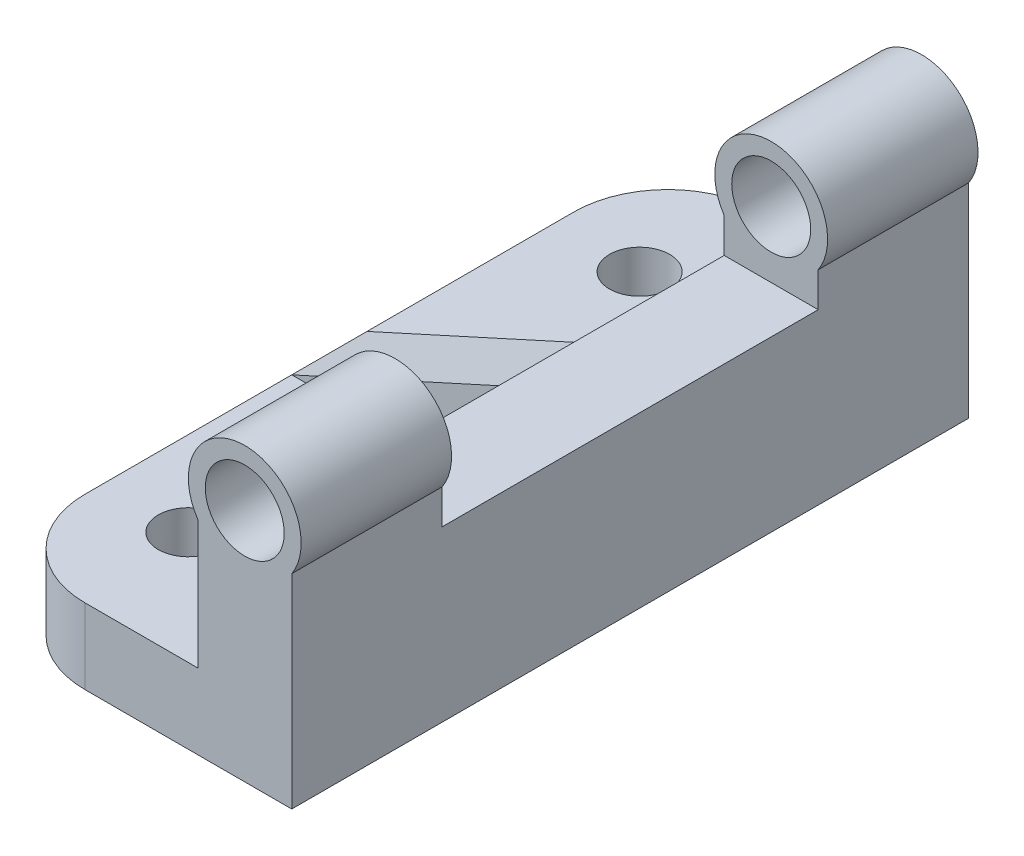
from build123d import *

# Parameters (mm, degrees)
BOSS_EXTRUDE1_DEPTH      = 12.5
SKETCH3_W                = 16
SKETCH3_H                = 36
BOSS_EXTRUDE2_DEPTH      = 4
SKETCH4_R                = 1.6
CUT_EXTRUDE1_DEPTH       = 9
SKETCH7_R                = 3
BOSS_EXTRUDE3_DEPTH      = 36
SKETCH8_R                = 2.1
CUT_EXTRUDE2_DEPTH       = 39
CUT_EXTRUDE3_DEPTH       = 8
BOSS_EXTRUDE4_DEPTH      = 2
BOSS_EXTRUDE4_DEPTH_BACK = 2
FILLET1_R                = 5
FILLET2_R                = 5


with BuildPart() as part:
    # Sketch2 → Boss-Extrude1 (new body)
    with BuildSketch(Plane(origin=(0, 0, 0), x_dir=(1, 0, 0), z_dir=(0, 1, 0))):
        Polygon((0, 0), (0, 18), (5, 18), (5, -18), (0, -18), align=None)
    extrude(amount=BOSS_EXTRUDE1_DEPTH)

    # Sketch3 → Boss-Extrude2 (add)
    with BuildSketch(Plane.XZ):
        with Locations((-3, 0)):
            Rectangle(SKETCH3_W, SKETCH3_H)
    extrude(amount=-BOSS_EXTRUDE2_DEPTH)

    # Sketch4 → Cut-Extrude1 (cut)
    with BuildSketch(Plane(origin=(0, 4, 0), x_dir=(1, 0, 0), z_dir=(0, 1, 0))):
        with Locations(Location((-6.5, -12, 0), (0, 0, 270))):
            Circle(SKETCH4_R)
        with Locations(Location((-6.5, 12, 0), (0, 0, 270))):
            Circle(SKETCH4_R)
    extrude(amount=-CUT_EXTRUDE1_DEPTH, mode=Mode.SUBTRACT)

    # Sketch7 → Boss-Extrude3 (add)
    with BuildSketch(Plane.XY.offset(18)):
        with Locations((2.5, 12.5)):
            Circle(SKETCH7_R)
    extrude(amount=-BOSS_EXTRUDE3_DEPTH)

    # Sketch8 → Cut-Extrude2 (cut)
    with BuildSketch(Plane.XY.offset(18)):
        with Locations((2.5, 12.5)):
            Circle(SKETCH8_R)
    extrude(amount=-CUT_EXTRUDE2_DEPTH, mode=Mode.SUBTRACT)

    # Sketch9 → Cut-Extrude3 (cut)
    with BuildSketch(Plane(origin=(0, 17, 0), x_dir=(1, 0, 0), z_dir=(0, 1, 0))):
        Polygon((7.352562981, 0), (7.352562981, 10), (-2.131530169, 10), (-2.131530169, -10), (7.352562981, -10), align=None)
    extrude(amount=-CUT_EXTRUDE3_DEPTH, mode=Mode.SUBTRACT)

    # Sketch10 → Boss-Extrude4 (add, two sides: drawn at the far end of the back side and taken through both)
    with BuildSketch(Plane.XY.offset(-BOSS_EXTRUDE4_DEPTH_BACK)):
        Polygon((-11, 4), (0, 4), (0, 9), align=None)
    extrude(amount=BOSS_EXTRUDE4_DEPTH + BOSS_EXTRUDE4_DEPTH_BACK)

    # Fillet1
    fillet1_edges = [part.edges().sort_by_distance(p)[0] for p in [
        (-11, 2, 18),
    ]]
    fillet(fillet1_edges, radius=FILLET1_R)

    # Fillet2
    fillet2_edges = [part.edges().sort_by_distance(p)[0] for p in [
        (-11, 2, -18),
    ]]
    fillet(fillet2_edges, radius=FILLET2_R)


solid = part.part
